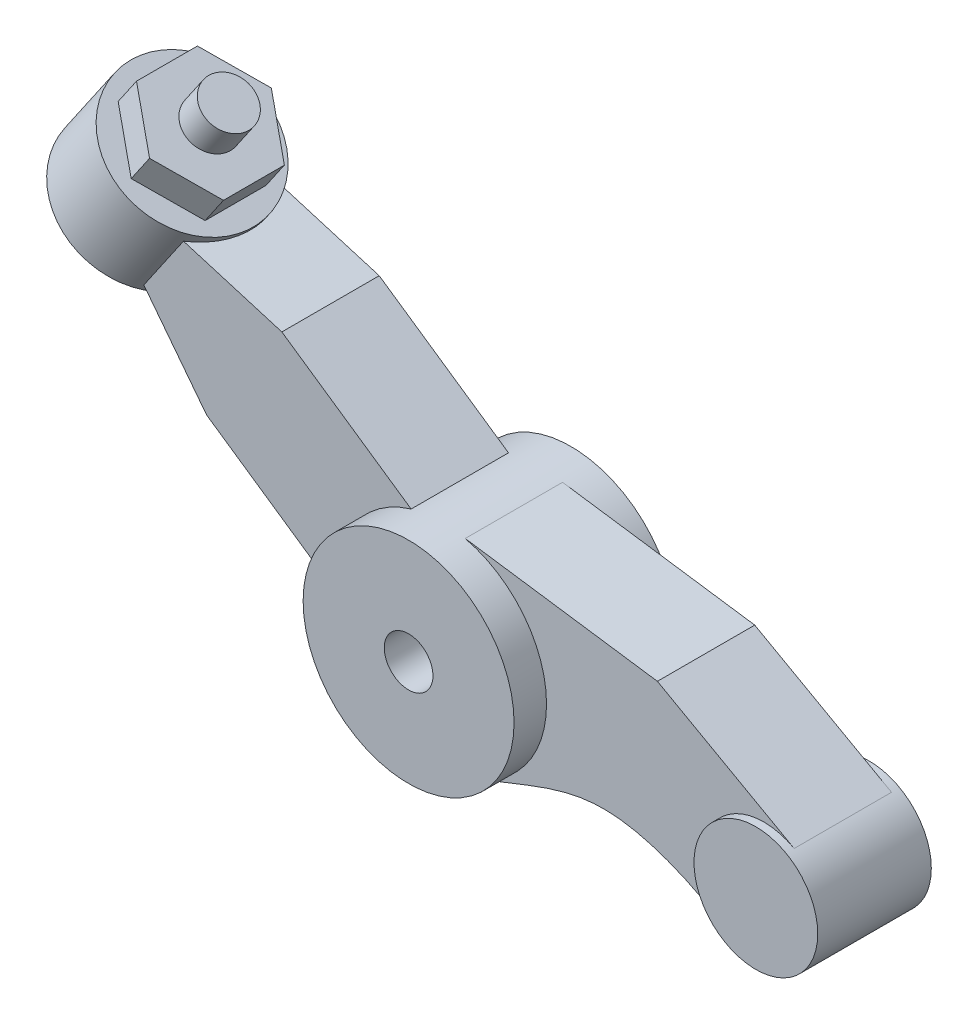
from build123d import *

# Parameters (mm, degrees)
SKETCH_1_R      = 1.3
SKETCH_1_R_2    = 0.3
EXTRUDE_1_DEPTH = 1
SKETCH_1_3_R    = 0.7625
EXTRUDE_2_DEPTH = 0.7
EXTRUDE_3_DEPTH = 0.6
EXTRUDE_4_DEPTH = 0.6
EXTRUDE_5_DEPTH = 0.4
SKETCH_5_R      = 0.3
EXTRUDE_6_DEPTH = 0.4


with BuildPart() as part:
    # Sketch 1 → Extrude 1 (new, symmetric)
    with BuildSketch(Plane.XY):
        Circle(SKETCH_1_R)
        Circle(SKETCH_1_R_2, mode=Mode.SUBTRACT)
    extrude(amount=EXTRUDE_1_DEPTH, both=True)



with BuildPart() as body_2:
    # Sketch 1_3 → Extrude 2 (new, symmetric)
    with BuildSketch(Plane.XY):
        with Locations((3.98, -0.682)):
            Circle(SKETCH_1_3_R)
    extrude(amount=EXTRUDE_2_DEPTH, both=True)


with BuildPart() as part_1:
    add(part.part)

    add(body_2.part)  # Extrude 3 merges body 2
    # Sketch 1_4 → Extrude 3 (add, symmetric)
    with BuildSketch(Plane.XY):
        with BuildLine():
            Line((2.666373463, 0.925478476), (0.297716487, 1.265450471))
            ThreePointArc((0.297716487, 1.265450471), (1.019075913, 0.807145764), (1.3, 0))
            ThreePointArc((1.3, 0), (1.075180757, -0.73074369), (0.478482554, -1.208740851))
            add(Edge.make_bspline(
                [(3.507701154, -1.28061511), (3.039197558, -0.994556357), (1.951174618, -0.508065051), (0.933637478, -1.05358893), (0.478482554, -1.208740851)],
                knots=[0, 0, 0, 0, 0.533404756, 1, 1, 1, 1], degree=3))
            ThreePointArc((3.507701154, -1.28061511), (3.345886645, -0.258554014), (4.351937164, -0.016365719))
            Line((4.351937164, -0.016365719), (2.666373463, 0.925478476))
        make_face()
    extrude(amount=EXTRUDE_3_DEPTH, both=True)

    # Sketch 1_5 → Extrude 4 (add, symmetric)
    with BuildSketch(Plane.XY):
        with BuildLine():
            Line((-1.962057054, 2.340394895), (-3.469420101, 2.791170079))
            Line((-3.469420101, 2.791170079), (-3.851452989, 2.234684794))
            Line((-3.851452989, 2.234684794), (-2.889123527, 0.989990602))
            Line((-2.889123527, 0.989990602), (-1.295848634, -0.103809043))
            ThreePointArc((-1.295848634, -0.103809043), (-1.071749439, 0.735767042), (-0.368782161, 1.24659525))
            Line((-0.368782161, 1.24659525), (-1.962057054, 2.340394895))
        make_face()
    extrude(amount=EXTRUDE_4_DEPTH, both=True)



with BuildPart() as body_2_2:
    # Sketch 2 → Revolve 1 (revolve)
    with BuildSketch(Plane.XY, mode=Mode.PRIVATE) as revolve_1_sk:
        with BuildLine():
            Line((-3.851452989, 2.234684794), (-3.443951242, 2.828269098))
            Line((-3.443951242, 2.828269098), (-3.769598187, 3.051829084))
            Line((-3.769598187, 3.051829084), (-4.833144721, 1.502622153))
            ThreePointArc((-4.833144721, 1.502622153), (-4.413018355, 1.520614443), (-4.313401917, 1.929156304))
            Line((-4.313401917, 1.929156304), (-3.851452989, 2.234684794))
        make_face()
    revolve(revolve_1_sk.sketch.rotate(Axis((-3.769598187, 3.051829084, 0), (-0.5659746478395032, -0.8244226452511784, 0)), 180), axis=Axis((-3.769598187, 3.051829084, 0), (-0.5659746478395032, -0.8244226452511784, 0)))


with BuildPart() as part_2:
    add(part_1.part)

    add(body_2_2.part)  # Revolve 2 merges body 2 2
    # Sketch 3 → Revolve 2 (revolve)
    with BuildSketch(Plane.XY):
        Polygon((-3.66853296, 3.199044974), (-4.277521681, 2.311966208), (-5.030219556, 2.828701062), (-4.421230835, 3.715779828), align=None)
    revolve(axis=Axis((-3.66853296, 3.199044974, 0), (-0.5659746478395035, -0.8244226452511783, 0)))

    # Sketch 4 → Extrude 5 (add)
    with BuildSketch(Plane(origin=(0.31755053, 0.462557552, 0), x_dir=(0.8244226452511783, -0.5659746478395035, 0), z_dir=(0.5659746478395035, 0.8244226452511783, 0))):
        Polygon((-4.835, 0.75055535), (-5.485, 0.375277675), (-5.485, -0.375277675), (-4.835, -0.75055535), (-4.185, -0.375277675), (-4.185, 0.375277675), align=None)
    extrude(amount=EXTRUDE_5_DEPTH)

    # Sketch 5 → Extrude 6 (add)
    with BuildSketch(Plane(origin=(0.543940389, 0.79232661, 0), x_dir=(0.8244226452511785, -0.5659746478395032, 0), z_dir=(0.5659746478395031, 0.8244226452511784, 0))):
        with Locations(Location((-4.835, 0, 0), (0, 0, 180))):
            Circle(SKETCH_5_R)
    extrude(amount=EXTRUDE_6_DEPTH)


solid = part_2.part
